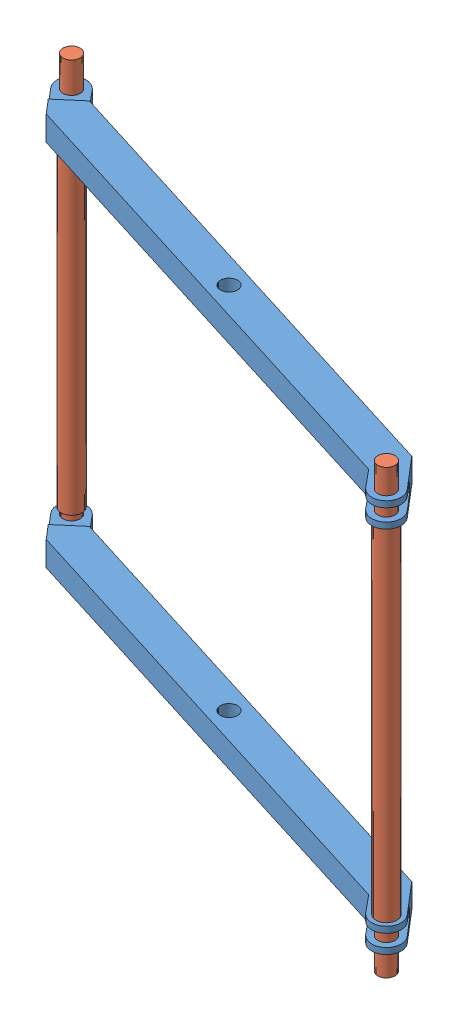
SolidWorks assembly layer_3.SLDASM, configuration Default (file format 11000). Lengths in mm.
Overall size (2311.11 1800 945.79).
4 component instances, 2 part files, 4 mates.
Components (placement in the parent):
- crossarm-1: crossarm.SLDPRT [Default] at (151.3438 750 1380.2057) x (0 -1 0) z (-0.954527 0 -0.298125) size (100 260 2340)
- crossarm-2: crossarm.SLDPRT [Default] at (151.3438 -750 1380.2057) x (0 -1 0) z (-0.954527 0 -0.298125) size (100 260 2340)
- cross_rod_short-1: cross_rod_short.SLDPRT [Default] at (-887.3124 0 982.4705) x (1 0 0) z (0 1 0) size (85 85 1800)
- cross_rod_short-2: cross_rod_short.SLDPRT [Default] at (1190 0 1777.941) x (1 0 0) z (0 -1 0) size (85 85 1800)
Mates (geometry in assembly coordinates):
- Concentric1: concentric: cylinder of assembly; cylinder of assembly; cylinder of crossarm-2 through (-887.3124 -775 982.4705) axis (0 1 0) radius 35; cylinder of cross_rod_short-1 through (-887.3124 900 982.4705) axis (0 -1 0) radius 35
- Distance1: distance = 100 mm: plane of assembly; plane of assembly; plane of cross_rod_short-1 through (-887.3124 -900 982.4705) normal (0 -1 0); plane of crossarm-2 through (-824.0519 -800 1148.898) normal (0 -1 0)
- Concentric2: concentric: cylinder of assembly; cylinder of assembly; cylinder of crossarm-2 through (1190 -700 1777.941) axis (0 -1 0) radius 35; cylinder of cross_rod_short-2 through (1190 -900 1777.941) axis (0 1 0) radius 35
- Coincident1: coincident: plane of assembly; plane of assembly; plane of cross_rod_short-1 through (-887.3124 -900 982.4705) normal (0 -1 0); plane of cross_rod_short-2 through (1190 -900 1777.941) normal (0 -1 0)
